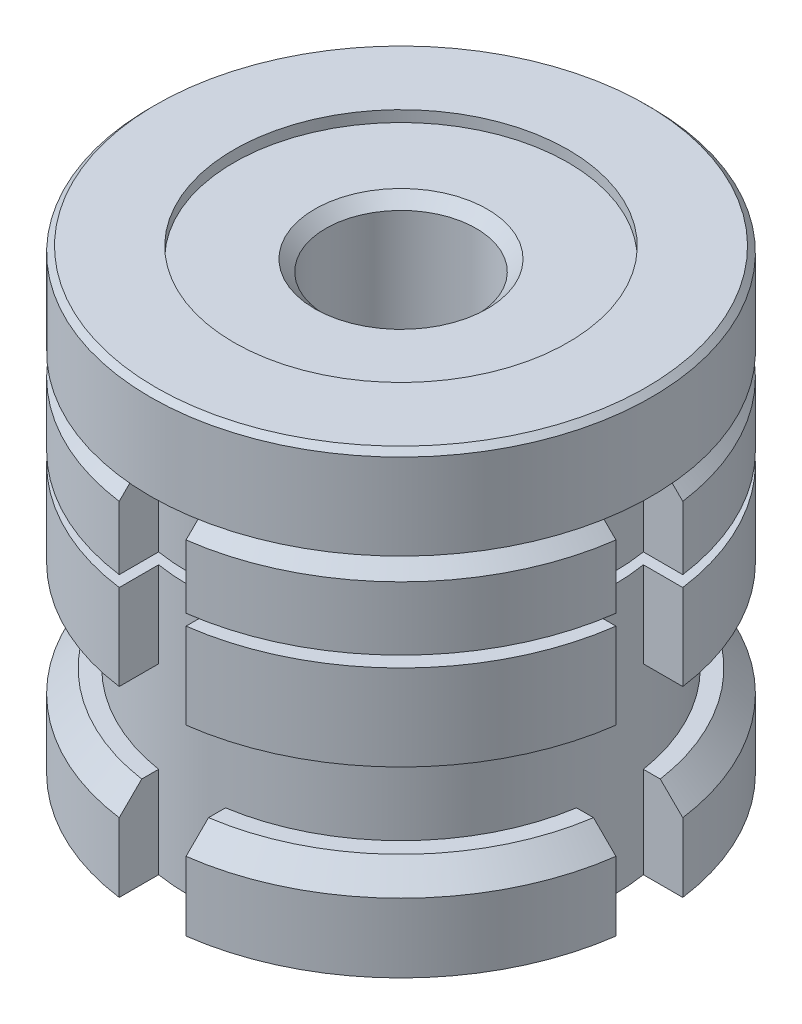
from build123d import *
from build123d.topology import SkipClean

# Parameters (mm, degrees)
SKETCH1_R           = 22.5
BOSS_EXTRUDE1_DEPTH = 16.4
SKETCH2_W           = 7.5
SKETCH2_H           = 1
SKETCH3_R           = 19
BOSS_EXTRUDE2_DEPTH = 16.4
SKETCH4_R           = 22.5
BOSS_EXTRUDE3_DEPTH = 8.2
CUT_EXTRUDE4_START  = -32.8
CUT_EXTRUDE4_DEPTH  = 32.8
CHAMFER1_SIZE       = 2
SKETCH6_R           = 22.5
BOSS_EXTRUDE4_DEPTH = 8.2
CHAMFER2_SIZE       = 0.5
CUT_EXTRUDE5_START  = -1
SKETCH7_R           = 15
CUT_EXTRUDE5_DEPTH  = 1
SKETCH8_R           = 6.75
CUT_EXTRUDE6_DEPTH  = 40
CHAMFER3_SIZE       = 1


with BuildPart() as part:
    # Sketch1 → Boss-Extrude1 (new body)
    with BuildSketch(Plane(origin=(0, 0, 0), x_dir=(1, 0, 0), z_dir=(0, 1, 0))):
        with Locations(Location((0, 0, 0), (0, 0, 270))):
            Circle(SKETCH1_R)
    extrude(amount=BOSS_EXTRUDE1_DEPTH)

    # Sketch2 → Cut-Revolve1 (revolve, cut)
    with BuildSketch(Plane(origin=(0, 0, 0), x_dir=(0, 0, -1), z_dir=(1, 0, 0))):
        with Locations((-18.75, 8.2)):
            Rectangle(SKETCH2_W, SKETCH2_H)
    revolve(axis=Axis((0, 13.26477, 0), (0, -1, 0)), mode=Mode.SUBTRACT)

    # Sketch3 → Boss-Extrude2 (add)
    with BuildSketch(Plane.XZ):
        with Locations(Location((0, 0, 0), (0, 0, 270))):
            Circle(SKETCH3_R)
    extrude(amount=BOSS_EXTRUDE2_DEPTH)

    # Sketch4 → Boss-Extrude3 (add)
    with BuildSketch(Plane.XZ.offset(16.4)):
        with Locations(Location((0, 0, 0), (0, 0, 90))):
            Circle(SKETCH4_R)
    extrude(amount=-BOSS_EXTRUDE3_DEPTH)

    # Sketch5 → Cut-Extrude4 (cut)
    with SkipClean():  # the faces are left unmerged after this step: merging them gives an invalid solid
        with BuildSketch(Plane(origin=(0, 16.4, 0), x_dir=(1, 0, 0), z_dir=(0, 1, 0)).offset(CUT_EXTRUDE4_START)):
            with BuildLine():
                Line((-22.299103, 3), (-18.761663, 3))
                ThreePointArc((-18.761663, 3), (-19, 0), (-18.761663, -3))
                Line((-18.761663, -3), (-22.299103, -3))
                ThreePointArc((-22.299103, -3), (-22.5, 0), (-22.299103, 3))
            make_face()
            with BuildLine():
                Line((-3, 22.299103), (-3, 18.761663))
                ThreePointArc((-3, 18.761663), (0, 19), (3, 18.761663))
                Line((3, 18.761663), (3, 22.299103))
                ThreePointArc((3, 22.299103), (0, 22.5), (-3, 22.299103))
            make_face()
            with BuildLine():
                Line((18.761663, 3), (22.299103, 3))
                ThreePointArc((22.299103, 3), (22.5, 0), (22.299103, -3))
                Line((22.299103, -3), (18.761663, -3))
                ThreePointArc((18.761663, -3), (19, 0), (18.761663, 3))
            make_face()
            with BuildLine():
                Line((-3, -18.761663), (-3, -22.299103))
                ThreePointArc((-3, -22.299103), (0, -22.5), (3, -22.299103))
                Line((3, -22.299103), (3, -18.761663))
                ThreePointArc((3, -18.761663), (0, -19), (-3, -18.761663))
            make_face()
        extrude(amount=CUT_EXTRUDE4_DEPTH, mode=Mode.SUBTRACT)

    # Chamfer1
    chamfer1_edges = [part.edges().sort_by_distance(p)[0] for p in [
        (15.909903, -8.2, -15.909903),
        (15.909903, -8.2, 15.909903),
        (-15.909903, -8.2, 15.909903),
        (-15.909903, -8.2, -15.909903),
        (15.909903, 16.4, 15.909903),
        (15.909903, 16.4, -15.909903),
        (-15.909903, 16.4, -15.909903),
        (-15.909903, 16.4, 15.909903),
    ]]
    chamfer(chamfer1_edges, length=CHAMFER1_SIZE)

    # Sketch6 → Boss-Extrude4 (add)
    with BuildSketch(Plane(origin=(0, 16.4, 0), x_dir=(1, 0, 0), z_dir=(0, 1, 0))):
        with Locations(Location((0, 0, 0), (0, 0, 270))):
            Circle(SKETCH6_R)
    extrude(amount=BOSS_EXTRUDE4_DEPTH)

    # Chamfer2
    chamfer2_edges = [part.edges().sort_by_distance(p)[0] for p in [
        (0, 24.6, -22.5),
    ]]
    chamfer(chamfer2_edges, length=CHAMFER2_SIZE)

    # Sketch7 → Cut-Extrude5 (cut)
    with BuildSketch(Plane(origin=(0, 24.6, 0), x_dir=(1, 0, 0), z_dir=(0, 1, 0)).offset(CUT_EXTRUDE5_START)):
        with Locations(Location((0, 0, 0), (0, 0, 270))):
            Circle(SKETCH7_R)
    extrude(amount=CUT_EXTRUDE5_DEPTH, mode=Mode.SUBTRACT)

    # Sketch8 → Cut-Extrude6 (cut)
    with BuildSketch(Plane(origin=(0, 23.6, 0), x_dir=(1, 0, 0), z_dir=(0, 1, 0))):
        with Locations(Location((0, 0, 0), (0, 0, 270))):
            Circle(SKETCH8_R)
    extrude(amount=-CUT_EXTRUDE6_DEPTH, mode=Mode.SUBTRACT)

    # Chamfer3
    chamfer3_edges = [part.edges().sort_by_distance(p)[0] for p in [
        (0, 23.6, -6.75),
        (0, -16.4, -6.75),
    ]]
    chamfer(chamfer3_edges, length=CHAMFER3_SIZE)


solid = part.part
